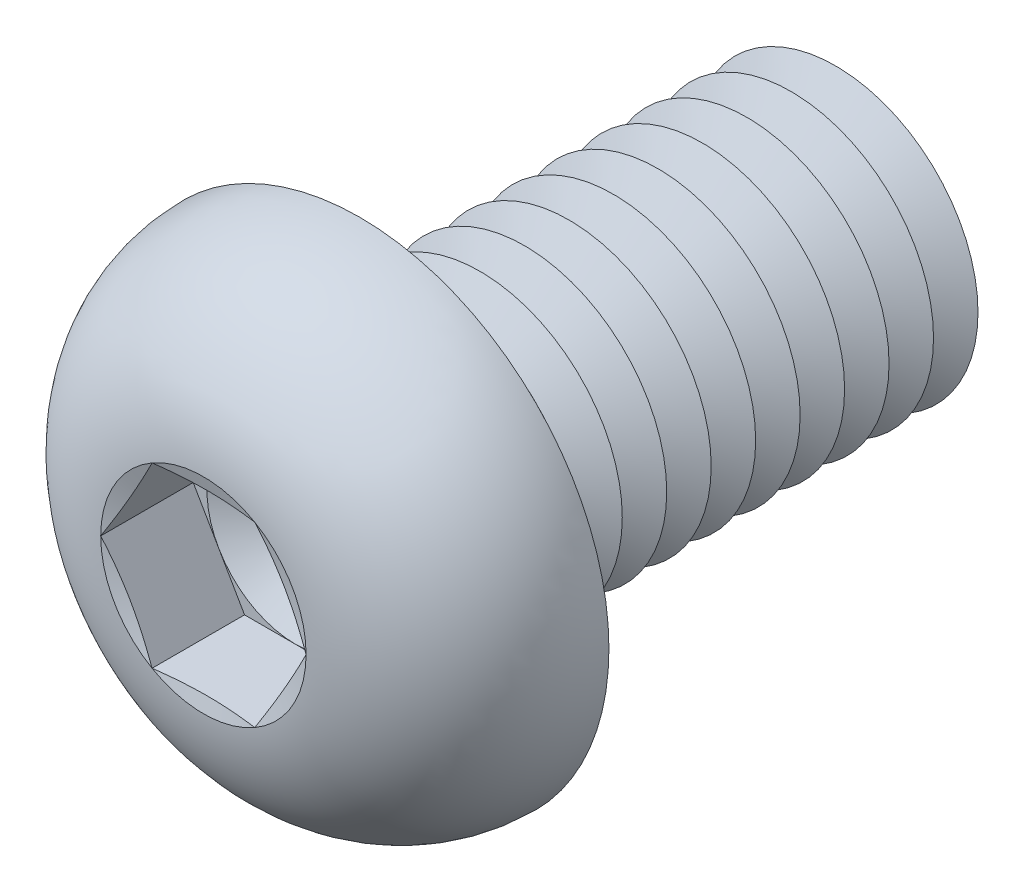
from build123d import *

# Parameters (mm, degrees)
FILLET1_R          = 0.625
LPATTERN1_COUNT    = 11
LPATTERN1_PITCH    = 1.25
CUT_EXTRUDE1_DEPTH = 2.6


with BuildPart() as part:
    # Sketch1 → Revolve1 (revolve)
    with BuildSketch(Plane(origin=(0, 0, 0), x_dir=(0, 0, -1), z_dir=(1, 0, 0)), mode=Mode.PRIVATE) as revolve1_sk:
        with BuildLine():
            Line((0, 4), (0, 7))
            ThreePointArc((0, 7), (-3.011595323, 5.81154966), (-4.4, 2.88675))
            Line((-4.4, 2.88675), (-4.013248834, 1.443375))
            Line((-4.013248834, 1.443375), (-4.4, 1.443375))
            Line((-4.4, 1.443375), (-4.4, 0))
            Line((-4.4, 0), (14, 0))
            Line((14, 0), (14, 4))
            Line((14, 4), (0, 4))
        make_face()
    revolve(revolve1_sk.sketch.rotate(Axis((0, 0, -14), (0, 0, 1)), 90), axis=Axis((0, 0, -14), (0, 0, 1)))

    # Fillet1
    fillet1_edges = [part.edges().sort_by_distance(p)[0] for p in [
        (4, 0, 0),
    ]]
    fillet(fillet1_edges, radius=FILLET1_R)

    # Sketch2 → Cut-Revolve1 (revolve, cut)
    with BuildSketch(Plane(origin=(0, 0, 0), x_dir=(0, 0, -1), z_dir=(1, 0, 0)), mode=Mode.PRIVATE) as cut_revolve1_sk:
        Polygon((13.375, 4), (14.625, 4), (14, 2.917468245), align=None)
    cut_revolve1 = revolve(cut_revolve1_sk.sketch.rotate(Axis((0, 0, -14), (0, 0, -1)), 270), axis=Axis((0, 0, -14), (0, 0, -1)), mode=Mode.SUBTRACT)

    # LPattern1: Cut-Revolve1 ×11
    with Locations(*[(0, 0, i * LPATTERN1_PITCH) for i in range(1, LPATTERN1_COUNT)]):
        add(cut_revolve1, mode=Mode.SUBTRACT)

    # Sketch3 → Cut-Extrude1 (cut)
    with BuildSketch(Plane.XY.offset(4.4)):
        Polygon((1.443375, 2.499998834), (-1.443375, 2.499998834), (-2.88675, 0), (-1.443375, -2.499998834), (1.443375, -2.499998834), (2.88675, 0), align=None)
    extrude(amount=-CUT_EXTRUDE1_DEPTH, mode=Mode.SUBTRACT)

    # Cut-Extrude2 cone 1 section (on through the dimple's axis) → Cut-Extrude2 (revolve, cut)
    with BuildSketch(Plane(origin=(0, 0, 1.8), x_dir=(0, -1, 0), z_dir=(1, 0, 0))):
        Polygon((0, 0), (2.499998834, 0), (0, 1.443375), align=None)
    revolve(axis=Axis((0, 0, 1.8), (0, 0, -1)), mode=Mode.SUBTRACT)


solid = part.part
